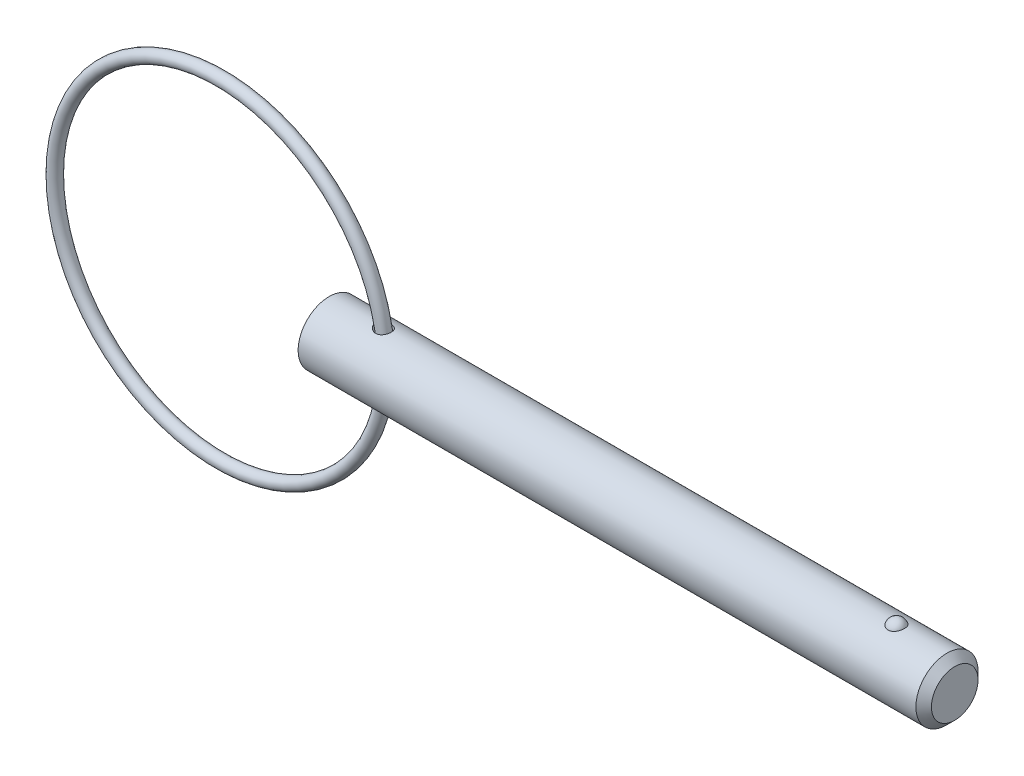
ISO-10303-21;
HEADER;
FILE_DESCRIPTION(('STEP AP214'),'2;1');
FILE_NAME('part.step','',(''),(''),'','','');
FILE_SCHEMA(('AUTOMOTIVE_DESIGN { 1 0 10303 214 1 1 1 1 }'));
ENDSEC;
DATA;
#1=APPLICATION_CONTEXT('core data for automotive mechanical design processes');
#2=APPLICATION_PROTOCOL_DEFINITION('international standard','automotive_design',2000,#1);
#3=PRODUCT_CONTEXT('',#1,'mechanical');
#4=PRODUCT('Part','Part','',(#3));
#5=PRODUCT_RELATED_PRODUCT_CATEGORY('part','',(#4));
#6=PRODUCT_DEFINITION_FORMATION('','',#4);
#7=PRODUCT_DEFINITION_CONTEXT('part definition',#1,'design');
#8=PRODUCT_DEFINITION('design','',#6,#7);
#9=PRODUCT_DEFINITION_SHAPE('','',#8);
#10=(LENGTH_UNIT() NAMED_UNIT(*) SI_UNIT(.MILLI.,.METRE.));
#11=(NAMED_UNIT(*) PLANE_ANGLE_UNIT() SI_UNIT($,.RADIAN.));
#12=(NAMED_UNIT(*) SI_UNIT($,.STERADIAN.) SOLID_ANGLE_UNIT());
#13=UNCERTAINTY_MEASURE_WITH_UNIT(LENGTH_MEASURE(1.E-05),#10,'distance_accuracy_value','');
#14=(GEOMETRIC_REPRESENTATION_CONTEXT(3) GLOBAL_UNCERTAINTY_ASSIGNED_CONTEXT((#13)) GLOBAL_UNIT_ASSIGNED_CONTEXT((#10,
#11,#12)) REPRESENTATION_CONTEXT('',''));
#15=CARTESIAN_POINT('',(0.,0.,0.));
#16=DIRECTION('',(0.,0.,1.));
#17=DIRECTION('',(1.,0.,0.));
#18=AXIS2_PLACEMENT_3D('',#15,#16,#17);
#19=CARTESIAN_POINT('',(-8.3302379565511,0.,0.));
#20=DIRECTION('',(0.,0.,1.));
#21=DIRECTION('',(1.,0.,0.));
#22=AXIS2_PLACEMENT_3D('',#19,#20,#21);
#23=TOROIDAL_SURFACE('',#22,12.7,0.476000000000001);
#24=CARTESIAN_POINT('',(4.8457620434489,0.,0.));
#25=VERTEX_POINT('',#24);
#26=VERTEX_LOOP('',#25);
#27=FACE_BOUND('',#26,.T.);
#28=ADVANCED_FACE('P0_F12',(#27),#23,.T.);
#29=CLOSED_SHELL('',(#28));
#30=MANIFOLD_SOLID_BREP('P0_B1',#29);
#31=CARTESIAN_POINT('',(0.,0.,0.));
#32=DIRECTION('',(1.,0.,0.));
#33=DIRECTION('',(0.,0.,-1.));
#34=AXIS2_PLACEMENT_3D('',#31,#32,#33);
#35=CYLINDRICAL_SURFACE('',#34,2.38);
#36=CARTESIAN_POINT('',(3.67748265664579,2.35074198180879,-0.372037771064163));
#37=CARTESIAN_POINT('',(3.70046616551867,2.34644965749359,-0.399158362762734));
#38=CARTESIAN_POINT('',(3.72581651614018,2.34199234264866,-0.424274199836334));
#39=CARTESIAN_POINT('',(3.78042747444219,2.33326580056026,-0.469907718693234));
#40=CARTESIAN_POINT('',(3.80969342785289,2.32899684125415,-0.490419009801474));
#41=CARTESIAN_POINT('',(3.87128330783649,2.32114904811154,-0.526312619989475));
#42=CARTESIAN_POINT('',(3.90360537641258,2.31756979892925,-0.541698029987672));
#43=CARTESIAN_POINT('',(3.9704452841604,2.31153734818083,-0.566889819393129));
#44=CARTESIAN_POINT('',(4.0049621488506,2.30908365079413,-0.576698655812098));
#45=CARTESIAN_POINT('',(4.07500735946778,2.30564492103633,-0.590297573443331));
#46=CARTESIAN_POINT('',(4.1105275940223,2.30465036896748,-0.594126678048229));
#47=CARTESIAN_POINT('',(4.18170718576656,2.30426876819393,-0.595606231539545));
#48=CARTESIAN_POINT('',(4.21736649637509,2.30488122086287,-0.593258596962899));
#49=CARTESIAN_POINT('',(4.28577822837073,2.30759475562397,-0.582609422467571));
#50=CARTESIAN_POINT('',(4.31858437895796,2.30961492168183,-0.574631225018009));
#51=CARTESIAN_POINT('',(4.38227060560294,2.31483318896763,-0.553233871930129));
#52=CARTESIAN_POINT('',(4.41315097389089,2.31803111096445,-0.539815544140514));
#53=CARTESIAN_POINT('',(4.4711825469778,2.3251225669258,-0.508384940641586));
#54=CARTESIAN_POINT('',(4.49841743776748,2.32899254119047,-0.490521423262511));
#55=CARTESIAN_POINT('',(4.5494826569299,2.33706025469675,-0.450515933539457));
#56=CARTESIAN_POINT('',(4.57331285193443,2.34125800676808,-0.42837379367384));
#57=CARTESIAN_POINT('',(4.6171621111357,2.34956202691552,-0.380209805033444));
#58=CARTESIAN_POINT('',(4.63714543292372,2.35366715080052,-0.354155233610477));
#59=CARTESIAN_POINT('',(4.67254725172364,2.36130301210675,-0.299034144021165));
#60=CARTESIAN_POINT('',(4.68796545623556,2.36483371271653,-0.26996743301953));
#61=CARTESIAN_POINT('',(4.71403776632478,2.37098548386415,-0.209215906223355));
#62=CARTESIAN_POINT('',(4.72462580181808,2.37359383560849,-0.177501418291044));
#63=CARTESIAN_POINT('',(4.74046966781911,2.37755210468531,-0.112692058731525));
#64=CARTESIAN_POINT('',(4.74572552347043,2.37890202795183,-0.0795971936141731));
#65=CARTESIAN_POINT('',(4.75077448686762,2.38019811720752,-0.0129544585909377));
#66=CARTESIAN_POINT('',(4.75056573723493,2.38014380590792,0.0205935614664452));
#67=CARTESIAN_POINT('',(4.74468604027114,2.37863606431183,0.0871753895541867));
#68=CARTESIAN_POINT('',(4.73901506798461,2.37718262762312,0.120209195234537));
#69=CARTESIAN_POINT('',(4.72236472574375,2.37303648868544,0.184779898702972));
#70=CARTESIAN_POINT('',(4.71139268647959,2.37034549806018,0.216318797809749));
#71=CARTESIAN_POINT('',(4.68441400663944,2.36401552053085,0.277063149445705));
#72=CARTESIAN_POINT('',(4.6684071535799,2.36037649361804,0.306268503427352));
#73=CARTESIAN_POINT('',(4.63170627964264,2.35253749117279,0.361595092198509));
#74=CARTESIAN_POINT('',(4.61100040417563,2.34833610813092,0.387708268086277));
#75=CARTESIAN_POINT('',(4.56544852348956,2.33984863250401,0.436017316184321));
#76=CARTESIAN_POINT('',(4.54060272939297,2.33556254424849,0.458213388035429));
#77=CARTESIAN_POINT('',(4.48760111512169,2.32742099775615,0.497916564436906));
#78=CARTESIAN_POINT('',(4.45946763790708,2.32356294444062,0.515452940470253));
#79=CARTESIAN_POINT('',(4.40055109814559,2.31668866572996,0.545520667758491));
#80=CARTESIAN_POINT('',(4.36976845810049,2.31367230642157,0.558052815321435));
#81=CARTESIAN_POINT('',(4.30694930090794,2.30886128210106,0.577633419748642));
#82=CARTESIAN_POINT('',(4.27493988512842,2.30704826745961,0.584764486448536));
#83=CARTESIAN_POINT('',(4.21014558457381,2.30475365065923,0.593744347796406));
#84=CARTESIAN_POINT('',(4.17736068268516,2.30427207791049,0.595593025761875));
#85=CARTESIAN_POINT('',(4.11170515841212,2.30466513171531,0.59406986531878));
#86=CARTESIAN_POINT('',(4.07883545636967,2.30554895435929,0.5906626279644));
#87=CARTESIAN_POINT('',(4.01408593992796,2.30856010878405,0.578780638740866));
#88=CARTESIAN_POINT('',(3.98220636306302,2.31068773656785,0.570304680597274));
#89=CARTESIAN_POINT('',(3.91877258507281,2.31605973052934,0.548090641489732));
#90=CARTESIAN_POINT('',(3.88730095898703,2.31935100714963,0.534128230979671));
#91=CARTESIAN_POINT('',(3.82705133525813,2.32664713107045,0.501391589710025));
#92=CARTESIAN_POINT('',(3.79827429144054,2.33065222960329,0.482615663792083));
#93=CARTESIAN_POINT('',(3.7429634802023,2.3391254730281,0.4397600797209));
#94=CARTESIAN_POINT('',(3.71658313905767,2.3436062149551,0.415484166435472));
#95=CARTESIAN_POINT('',(3.6683951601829,2.35235146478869,0.362706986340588));
#96=CARTESIAN_POINT('',(3.64658727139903,2.35661598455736,0.334205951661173));
#97=CARTESIAN_POINT('',(3.60882605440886,2.36432007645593,0.27436882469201));
#98=CARTESIAN_POINT('',(3.59274982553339,2.36777633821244,0.243112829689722));
#99=CARTESIAN_POINT('',(3.56652169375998,2.3735493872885,0.178112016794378));
#100=CARTESIAN_POINT('',(3.5563653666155,2.3758670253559,0.144369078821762));
#101=CARTESIAN_POINT('',(3.54309691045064,2.37891982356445,0.0783638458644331));
#102=CARTESIAN_POINT('',(3.53947205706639,2.37976992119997,0.0462095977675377));
#103=CARTESIAN_POINT('',(3.53785288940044,2.38014795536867,-0.018248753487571));
#104=CARTESIAN_POINT('',(3.5398575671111,2.37967612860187,-0.0505528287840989));
#105=CARTESIAN_POINT('',(3.54913867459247,2.37752661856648,-0.112617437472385));
#106=CARTESIAN_POINT('',(3.5561353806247,2.37591295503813,-0.142422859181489));
#107=CARTESIAN_POINT('',(3.5747775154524,2.37172196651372,-0.200451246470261));
#108=CARTESIAN_POINT('',(3.58642049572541,2.36914514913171,-0.228675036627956));
#109=CARTESIAN_POINT('',(3.61071901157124,2.36396321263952,-0.276620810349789));
#110=CARTESIAN_POINT('',(3.62251818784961,2.36150235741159,-0.296799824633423));
#111=CARTESIAN_POINT('',(3.64836661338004,2.35629864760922,-0.335619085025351));
#112=CARTESIAN_POINT('',(3.66241608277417,2.353555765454,-0.354259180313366));
#113=CARTESIAN_POINT('',(3.67748265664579,2.35074198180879,-0.372037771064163));
#114=B_SPLINE_CURVE_WITH_KNOTS('',3,(#36,#37,#38,#39,#40,#41,#42,#43,#44,#45,#46,#47,#48,#49,
#50,#51,#52,#53,#54,#55,#56,#57,#58,#59,#60,#61,#62,#63,#64,#65,#66,#67,#68,#69,#70,#71,#72,#73,
#74,#75,#76,#77,#78,#79,#80,#81,#82,#83,#84,#85,#86,#87,#88,#89,#90,#91,#92,#93,#94,#95,#96,#97,
#98,#99,#100,#101,#102,#103,#104,#105,#106,#107,#108,#109,#110,#111,#112,#113),.UNSPECIFIED.,
.T.,.F.,(4,2,2,2,2,2,2,2,2,2,2,2,2,2,2,2,2,2,2,2,2,2,2,2,2,2,2,2,2,2,2,2,2,2,2,2,2,2,4),(0.,
0.107335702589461,0.214819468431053,0.322238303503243,0.429609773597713,0.536277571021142,
0.642912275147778,0.743874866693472,0.844822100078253,0.942762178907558,1.04070609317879,
1.13952022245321,1.23834068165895,1.33847507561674,1.43860899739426,1.53877695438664,
1.63894536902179,1.7389756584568,1.83901017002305,1.93929990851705,2.03958453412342,
2.13922343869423,2.23884648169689,2.33691317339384,2.43498203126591,2.53371427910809,
2.63247003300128,2.73577311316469,2.83911262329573,2.94697761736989,3.05483668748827,
3.16021984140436,3.2655241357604,3.36212700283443,3.45871257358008,3.55027266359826,
3.64178456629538,3.71214035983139,3.78250304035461),.UNSPECIFIED.);
#115=CARTESIAN_POINT('',(3.67748265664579,2.35074198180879,-0.372037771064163));
#116=VERTEX_POINT('',#115);
#117=EDGE_CURVE('P1_E40',#116,#116,#114,.T.);
#118=ORIENTED_EDGE('',*,*,#117,.T.);
#119=EDGE_LOOP('',(#118));
#120=FACE_BOUND('',#119,.T.);
#121=CARTESIAN_POINT('',(47.335,0.,0.));
#122=DIRECTION('',(1.,0.,0.));
#123=DIRECTION('',(0.,0.,-1.));
#124=AXIS2_PLACEMENT_3D('',#121,#122,#123);
#125=CIRCLE('',#124,2.38);
#126=CARTESIAN_POINT('',(47.335,0.,-2.38));
#127=VERTEX_POINT('',#126);
#128=EDGE_CURVE('P1_E25',#127,#127,#125,.T.);
#129=ORIENTED_EDGE('',*,*,#128,.F.);
#130=EDGE_LOOP('',(#129));
#131=FACE_BOUND('',#130,.T.);
#132=CARTESIAN_POINT('',(0.,0.,0.));
#133=DIRECTION('',(1.,0.,0.));
#134=DIRECTION('',(0.,0.,-1.));
#135=AXIS2_PLACEMENT_3D('',#132,#133,#134);
#136=CIRCLE('',#135,2.38);
#137=CARTESIAN_POINT('',(0.,0.,-2.38));
#138=VERTEX_POINT('',#137);
#139=EDGE_CURVE('P1_E9',#138,#138,#136,.T.);
#140=ORIENTED_EDGE('',*,*,#139,.T.);
#141=EDGE_LOOP('',(#140));
#142=FACE_BOUND('',#141,.T.);
#143=CARTESIAN_POINT('',(43.4634492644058,2.2921568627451,0.64063789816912));
#144=CARTESIAN_POINT('',(43.4303559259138,2.29215737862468,0.640637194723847));
#145=CARTESIAN_POINT('',(43.3972546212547,2.29293179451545,0.63788468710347));
#146=CARTESIAN_POINT('',(43.3320176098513,2.29594030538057,0.626968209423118));
#147=CARTESIAN_POINT('',(43.2998823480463,2.29817506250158,0.618801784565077));
#148=CARTESIAN_POINT('',(43.2375402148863,2.30384308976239,0.597351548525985));
#149=CARTESIAN_POINT('',(43.2073305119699,2.30727454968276,0.58407546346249));
#150=CARTESIAN_POINT('',(43.1495674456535,2.31495941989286,0.552829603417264));
#151=CARTESIAN_POINT('',(43.1220141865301,2.31921286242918,0.534859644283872));
#152=CARTESIAN_POINT('',(43.0695938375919,2.32820213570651,0.494282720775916));
#153=CARTESIAN_POINT('',(43.0448050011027,2.33294694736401,0.471576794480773));
#154=CARTESIAN_POINT('',(42.9992169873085,2.34234144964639,0.422446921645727));
#155=CARTESIAN_POINT('',(42.9784185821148,2.34699112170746,0.396022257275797));
#156=CARTESIAN_POINT('',(42.9403580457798,2.35593942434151,0.338855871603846));
#157=CARTESIAN_POINT('',(42.9233051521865,2.36021170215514,0.30797060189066));
#158=CARTESIAN_POINT('',(42.8943607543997,2.3677057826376,0.24375057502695));
#159=CARTESIAN_POINT('',(42.8824701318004,2.37092740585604,0.210415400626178));
#160=CARTESIAN_POINT('',(42.8638076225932,2.37606901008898,0.141189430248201));
#161=CARTESIAN_POINT('',(42.8571956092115,2.37794816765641,0.105252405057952));
#162=CARTESIAN_POINT('',(42.8498095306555,2.38005135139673,0.0327351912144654));
#163=CARTESIAN_POINT('',(42.8490358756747,2.38027526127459,-0.00384504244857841));
#164=CARTESIAN_POINT('',(42.8533628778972,2.37903842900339,-0.0769838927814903));
#165=CARTESIAN_POINT('',(42.8585202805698,2.37756141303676,-0.113538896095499));
#166=CARTESIAN_POINT('',(42.8747013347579,2.37305303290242,-0.185229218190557));
#167=CARTESIAN_POINT('',(42.8857251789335,2.37002161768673,-0.220364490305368));
#168=CARTESIAN_POINT('',(42.9133977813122,2.36273722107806,-0.288156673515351));
#169=CARTESIAN_POINT('',(42.9300389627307,2.35848588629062,-0.320816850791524));
#170=CARTESIAN_POINT('',(42.9685984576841,2.34923130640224,-0.382744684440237));
#171=CARTESIAN_POINT('',(42.990516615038,2.34422808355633,-0.41201244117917));
#172=CARTESIAN_POINT('',(43.0387549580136,2.33412555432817,-0.46583000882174));
#173=CARTESIAN_POINT('',(43.065002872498,2.32902887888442,-0.490444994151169));
#174=CARTESIAN_POINT('',(43.1214769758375,2.31926941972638,-0.5347003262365));
#175=CARTESIAN_POINT('',(43.151702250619,2.3146065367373,-0.554341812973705));
#176=CARTESIAN_POINT('',(43.2140618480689,2.30645675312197,-0.587312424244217));
#177=CARTESIAN_POINT('',(43.2460780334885,2.30293152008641,-0.600855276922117));
#178=CARTESIAN_POINT('',(43.3120795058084,2.29725171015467,-0.622220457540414));
#179=CARTESIAN_POINT('',(43.3460641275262,2.29509667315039,-0.630044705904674));
#180=CARTESIAN_POINT('',(43.413299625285,2.29249264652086,-0.639452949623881));
#181=CARTESIAN_POINT('',(43.4465087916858,2.29196755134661,-0.641315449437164));
#182=CARTESIAN_POINT('',(43.512763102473,2.29246849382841,-0.639522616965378));
#183=CARTESIAN_POINT('',(43.5458082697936,2.29349430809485,-0.635868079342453));
#184=CARTESIAN_POINT('',(43.6101025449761,2.29694059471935,-0.623301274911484));
#185=CARTESIAN_POINT('',(43.6413744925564,2.29933234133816,-0.614497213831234));
#186=CARTESIAN_POINT('',(43.7019952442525,2.30522511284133,-0.592006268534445));
#187=CARTESIAN_POINT('',(43.7313438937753,2.30872622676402,-0.578318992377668));
#188=CARTESIAN_POINT('',(43.7880369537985,2.31655795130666,-0.546112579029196));
#189=CARTESIAN_POINT('',(43.815320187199,2.32090569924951,-0.527490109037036));
#190=CARTESIAN_POINT('',(43.8664904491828,2.32992206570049,-0.486117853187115));
#191=CARTESIAN_POINT('',(43.8903767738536,2.33459075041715,-0.463367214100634));
#192=CARTESIAN_POINT('',(43.9352722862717,2.34399834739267,-0.413220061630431));
#193=CARTESIAN_POINT('',(43.9560972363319,2.34873051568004,-0.385657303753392));
#194=CARTESIAN_POINT('',(43.993056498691,2.35754932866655,-0.327455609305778));
#195=CARTESIAN_POINT('',(44.0091898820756,2.36163584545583,-0.296816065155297));
#196=CARTESIAN_POINT('',(44.0369822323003,2.36889321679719,-0.23204704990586));
#197=CARTESIAN_POINT('',(44.0484450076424,2.37202275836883,-0.197828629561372));
#198=CARTESIAN_POINT('',(44.0657523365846,2.37681926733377,-0.127900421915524));
#199=CARTESIAN_POINT('',(44.0715962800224,2.37848607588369,-0.0921904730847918));
#200=CARTESIAN_POINT('',(44.077605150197,2.38020024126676,-0.0196348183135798));
#201=CARTESIAN_POINT('',(44.0776704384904,2.38021918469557,0.017219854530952));
#202=CARTESIAN_POINT('',(44.0718689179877,2.37856356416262,0.09042190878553));
#203=CARTESIAN_POINT('',(44.0660018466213,2.37688892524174,0.126769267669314));
#204=CARTESIAN_POINT('',(44.048425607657,2.37201688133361,0.198028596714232));
#205=CARTESIAN_POINT('',(44.0366998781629,2.36881516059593,0.232936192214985));
#206=CARTESIAN_POINT('',(44.0076354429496,2.36123444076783,0.300196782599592));
#207=CARTESIAN_POINT('',(43.9902967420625,2.3568554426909,0.332549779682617));
#208=CARTESIAN_POINT('',(43.9505350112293,2.34744667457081,0.393495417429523));
#209=CARTESIAN_POINT('',(43.9281528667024,2.34242227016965,0.422115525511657));
#210=CARTESIAN_POINT('',(43.8787391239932,2.33227293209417,0.475004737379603));
#211=CARTESIAN_POINT('',(43.8517076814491,2.32714800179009,0.499273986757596));
#212=CARTESIAN_POINT('',(43.7944988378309,2.31755359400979,0.542046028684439));
#213=CARTESIAN_POINT('',(43.7644297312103,2.3130698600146,0.56069032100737));
#214=CARTESIAN_POINT('',(43.7013869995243,2.3051412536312,0.59244718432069));
#215=CARTESIAN_POINT('',(43.6684158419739,2.30169550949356,0.605564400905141));
#216=CARTESIAN_POINT('',(43.6068424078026,2.29677744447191,0.623927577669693));
#217=CARTESIAN_POINT('',(43.5785555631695,2.29505839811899,0.630178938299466));
#218=CARTESIAN_POINT('',(43.5213308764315,2.29274795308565,0.638534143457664));
#219=CARTESIAN_POINT('',(43.4923931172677,2.29215641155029,0.640638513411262));
#220=CARTESIAN_POINT('',(43.4634492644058,2.2921568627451,0.64063789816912));
#221=B_SPLINE_CURVE_WITH_KNOTS('',3,(#143,#144,#145,#146,#147,#148,#149,#150,#151,#152,#153,
#154,#155,#156,#157,#158,#159,#160,#161,#162,#163,#164,#165,#166,#167,#168,#169,#170,#171,#172,
#173,#174,#175,#176,#177,#178,#179,#180,#181,#182,#183,#184,#185,#186,#187,#188,#189,#190,#191,
#192,#193,#194,#195,#196,#197,#198,#199,#200,#201,#202,#203,#204,#205,#206,#207,#208,#209,#210,
#211,#212,#213,#214,#215,#216,#217,#218,#219,#220),.UNSPECIFIED.,.T.,.F.,(4,2,2,2,2,2,2,2,2,2,2,
2,2,2,2,2,2,2,2,2,2,2,2,2,2,2,2,2,2,2,2,2,2,2,2,2,2,2,4),(0.,0.0991724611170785,
0.198389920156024,0.29745794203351,0.396529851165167,0.497927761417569,0.599345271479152,
0.705475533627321,0.811623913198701,0.920876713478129,1.03013718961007,1.14045177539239,
1.25076998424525,1.36093998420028,1.47110672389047,1.57959248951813,1.68805336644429,
1.79234266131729,1.89659691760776,1.9959039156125,2.09519661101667,2.19247425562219,
2.28975970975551,2.38926978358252,2.4888004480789,2.59293588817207,2.69709193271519,
2.80525821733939,2.9134362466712,3.02347917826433,3.13352698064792,3.243887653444,
3.3542482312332,3.46374443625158,3.57323697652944,3.67968690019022,3.78604717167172,
3.87279565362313,3.95953314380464),.UNSPECIFIED.);
#222=CARTESIAN_POINT('',(43.4634492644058,2.2921568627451,0.64063789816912));
#223=VERTEX_POINT('',#222);
#224=EDGE_CURVE('P1_E34',#223,#223,#221,.T.);
#225=ORIENTED_EDGE('',*,*,#224,.T.);
#226=EDGE_LOOP('',(#225));
#227=FACE_BOUND('',#226,.T.);
#228=CARTESIAN_POINT('',(3.67748265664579,-2.35074198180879,-0.372037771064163));
#229=CARTESIAN_POINT('',(3.65652023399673,-2.35465684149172,-0.34730037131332));
#230=CARTESIAN_POINT('',(3.63751328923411,-2.35843676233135,-0.320880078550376));
#231=CARTESIAN_POINT('',(3.60404107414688,-2.36534227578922,-0.265218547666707));
#232=CARTESIAN_POINT('',(3.58957485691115,-2.36846800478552,-0.235977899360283));
#233=CARTESIAN_POINT('',(3.56572865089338,-2.37373250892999,-0.17528149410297));
#234=CARTESIAN_POINT('',(3.55636565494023,-2.37586798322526,-0.143818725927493));
#235=CARTESIAN_POINT('',(3.54325775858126,-2.37888184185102,-0.0796854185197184));
#236=CARTESIAN_POINT('',(3.539510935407,-2.37976065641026,-0.047015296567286));
#237=CARTESIAN_POINT('',(3.53787230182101,-2.38014359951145,0.0167788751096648));
#238=CARTESIAN_POINT('',(3.53968714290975,-2.37971660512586,0.0478953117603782));
#239=CARTESIAN_POINT('',(3.54844977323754,-2.37768530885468,0.10935299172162));
#240=CARTESIAN_POINT('',(3.55539746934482,-2.37608102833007,0.139694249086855));
#241=CARTESIAN_POINT('',(3.57400783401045,-2.37189301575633,0.198451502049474));
#242=CARTESIAN_POINT('',(3.58561918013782,-2.36931996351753,0.226884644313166));
#243=CARTESIAN_POINT('',(3.61310377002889,-2.36345094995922,0.281524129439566));
#244=CARTESIAN_POINT('',(3.62897804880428,-2.36015481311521,0.307729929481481));
#245=CARTESIAN_POINT('',(3.66562367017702,-2.35291979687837,0.359001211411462));
#246=CARTESIAN_POINT('',(3.68664499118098,-2.34895316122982,0.38388386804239));
#247=CARTESIAN_POINT('',(3.73230875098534,-2.34094029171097,0.430056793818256));
#248=CARTESIAN_POINT('',(3.75695270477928,-2.33689402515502,0.451345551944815));
#249=CARTESIAN_POINT('',(3.81128123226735,-2.32880869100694,0.491427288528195));
#250=CARTESIAN_POINT('',(3.84120889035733,-2.32479472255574,0.509896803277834));
#251=CARTESIAN_POINT('',(3.90376464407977,-2.31758417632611,0.541729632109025));
#252=CARTESIAN_POINT('',(3.93639323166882,-2.31438774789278,0.555092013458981));
#253=CARTESIAN_POINT('',(4.00416670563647,-2.30915137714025,0.576493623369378));
#254=CARTESIAN_POINT('',(4.0393485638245,-2.30713552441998,0.584422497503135));
#255=CARTESIAN_POINT('',(4.11060438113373,-2.30465258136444,0.594140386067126));
#256=CARTESIAN_POINT('',(4.14667802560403,-2.30418495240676,0.595931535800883));
#257=CARTESIAN_POINT('',(4.21693481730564,-2.30488473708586,0.593218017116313));
#258=CARTESIAN_POINT('',(4.25112951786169,-2.30597897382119,0.588995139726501));
#259=CARTESIAN_POINT('',(4.31821509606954,-2.30956729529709,0.57476284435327));
#260=CARTESIAN_POINT('',(4.35110629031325,-2.31206103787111,0.564754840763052));
#261=CARTESIAN_POINT('',(4.41316900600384,-2.31802118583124,0.53975368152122));
#262=CARTESIAN_POINT('',(4.44243993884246,-2.32144077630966,0.524995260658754));
#263=CARTESIAN_POINT('',(4.49802365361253,-2.32890801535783,0.49080792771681));
#264=CARTESIAN_POINT('',(4.52433643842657,-2.33295566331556,0.471379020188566));
#265=CARTESIAN_POINT('',(4.57327790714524,-2.3412242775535,0.428422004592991));
#266=CARTESIAN_POINT('',(4.59591094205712,-2.34544503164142,0.404898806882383));
#267=CARTESIAN_POINT('',(4.63697038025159,-2.35360640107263,0.354387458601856));
#268=CARTESIAN_POINT('',(4.65539647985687,-2.35754699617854,0.327399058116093));
#269=CARTESIAN_POINT('',(4.68784943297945,-2.36478461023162,0.270249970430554));
#270=CARTESIAN_POINT('',(4.70180333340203,-2.36807065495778,0.240046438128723));
#271=CARTESIAN_POINT('',(4.72457181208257,-2.3735656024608,0.177668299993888));
#272=CARTESIAN_POINT('',(4.73338630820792,-2.37577448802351,0.145493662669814));
#273=CARTESIAN_POINT('',(4.74568442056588,-2.37888446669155,0.0799353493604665));
#274=CARTESIAN_POINT('',(4.74914498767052,-2.37977990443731,0.0465470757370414));
#275=CARTESIAN_POINT('',(4.75057509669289,-2.38014803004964,-0.0203543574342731));
#276=CARTESIAN_POINT('',(4.74854468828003,-2.37962073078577,-0.0538675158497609));
#277=CARTESIAN_POINT('',(4.73905606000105,-2.37720346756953,-0.119981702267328));
#278=CARTESIAN_POINT('',(4.73161109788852,-2.37531683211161,-0.152584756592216));
#279=CARTESIAN_POINT('',(4.71149336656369,-2.37038779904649,-0.21604453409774));
#280=CARTESIAN_POINT('',(4.69882040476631,-2.36734535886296,-0.246901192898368));
#281=CARTESIAN_POINT('',(4.66852750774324,-2.3604270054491,-0.306062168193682));
#282=CARTESIAN_POINT('',(4.65089743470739,-2.35654938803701,-0.334361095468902));
#283=CARTESIAN_POINT('',(4.61113860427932,-2.34839114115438,-0.387535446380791));
#284=CARTESIAN_POINT('',(4.5890098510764,-2.34411051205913,-0.412410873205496));
#285=CARTESIAN_POINT('',(4.54086484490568,-2.33563475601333,-0.457982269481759));
#286=CARTESIAN_POINT('',(4.51485596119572,-2.33143948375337,-0.478685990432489));
#287=CARTESIAN_POINT('',(4.45962330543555,-2.32360655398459,-0.515369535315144));
#288=CARTESIAN_POINT('',(4.43040000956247,-2.31996881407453,-0.53135005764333));
#289=CARTESIAN_POINT('',(4.37002624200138,-2.31371771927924,-0.557938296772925));
#290=CARTESIAN_POINT('',(4.33891082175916,-2.31108995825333,-0.56862225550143));
#291=CARTESIAN_POINT('',(4.27527207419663,-2.30707117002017,-0.584715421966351));
#292=CARTESIAN_POINT('',(4.24274884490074,-2.30568005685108,-0.590124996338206));
#293=CARTESIAN_POINT('',(4.17738918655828,-2.30427145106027,-0.595601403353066));
#294=CARTESIAN_POINT('',(4.14455499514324,-2.3042474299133,-0.595693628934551));
#295=CARTESIAN_POINT('',(4.07930726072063,-2.30552664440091,-0.590722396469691));
#296=CARTESIAN_POINT('',(4.04689380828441,-2.3068301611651,-0.585657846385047));
#297=CARTESIAN_POINT('',(3.98220150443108,-2.31066076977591,-0.570360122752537));
#298=CARTESIAN_POINT('',(3.94996602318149,-2.31322859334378,-0.559954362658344));
#299=CARTESIAN_POINT('',(3.88760707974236,-2.31930140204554,-0.534242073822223));
#300=CARTESIAN_POINT('',(3.85748403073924,-2.32280656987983,-0.518934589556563));
#301=CARTESIAN_POINT('',(3.80033132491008,-2.33034138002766,-0.483968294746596));
#302=CARTESIAN_POINT('',(3.77327623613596,-2.33436601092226,-0.464349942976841));
#303=CARTESIAN_POINT('',(3.72262060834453,-2.34255524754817,-0.421092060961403));
#304=CARTESIAN_POINT('',(3.69901956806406,-2.34671983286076,-0.397453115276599));
#305=CARTESIAN_POINT('',(3.67748265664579,-2.35074198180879,-0.372037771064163));
#306=B_SPLINE_CURVE_WITH_KNOTS('',3,(#228,#229,#230,#231,#232,#233,#234,#235,#236,#237,#238,
#239,#240,#241,#242,#243,#244,#245,#246,#247,#248,#249,#250,#251,#252,#253,#254,#255,#256,#257,
#258,#259,#260,#261,#262,#263,#264,#265,#266,#267,#268,#269,#270,#271,#272,#273,#274,#275,#276,
#277,#278,#279,#280,#281,#282,#283,#284,#285,#286,#287,#288,#289,#290,#291,#292,#293,#294,#295,
#296,#297,#298,#299,#300,#301,#302,#303,#304,#305),.UNSPECIFIED.,.T.,.F.,(4,2,2,2,2,2,2,2,2,2,2,
2,2,2,2,2,2,2,2,2,2,2,2,2,2,2,2,2,2,2,2,2,2,2,2,2,2,2,4),(0.,0.09787553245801,0.19573064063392,
0.293909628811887,0.39205499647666,0.485114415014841,0.578172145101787,0.670232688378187,
0.762315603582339,0.860342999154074,0.958411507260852,1.06411708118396,1.16984195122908,
1.27765506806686,1.38543067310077,1.48831936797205,1.59118291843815,1.68959047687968,
1.78799793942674,1.88628818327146,1.98458551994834,2.08441314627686,2.18424236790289,
2.28450017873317,2.3847570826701,2.4847693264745,2.58478525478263,2.68500723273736,
2.78522911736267,2.8852630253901,2.98528213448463,3.08381637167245,3.18234375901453,
3.28040059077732,3.37847819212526,3.47994551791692,3.58143263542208,3.68200512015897,
3.78256299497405),.UNSPECIFIED.);
#307=CARTESIAN_POINT('',(3.67748265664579,-2.35074198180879,-0.372037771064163));
#308=VERTEX_POINT('',#307);
#309=EDGE_CURVE('P1_E17',#308,#308,#306,.T.);
#310=ORIENTED_EDGE('',*,*,#309,.T.);
#311=EDGE_LOOP('',(#310));
#312=FACE_BOUND('',#311,.T.);
#313=ADVANCED_FACE('P1_F13',(#120,#131,#142,#227,#312),#35,.T.);
#314=CARTESIAN_POINT('',(0.,0.,0.));
#315=DIRECTION('',(-1.,0.,0.));
#316=DIRECTION('',(0.,0.,1.));
#317=AXIS2_PLACEMENT_3D('',#314,#315,#316);
#318=PLANE('',#317);
#319=ORIENTED_EDGE('',*,*,#139,.F.);
#320=EDGE_LOOP('',(#319));
#321=FACE_BOUND('',#320,.T.);
#322=ADVANCED_FACE('P1_F15',(#321),#318,.T.);
#323=CARTESIAN_POINT('',(47.93,0.,0.));
#324=DIRECTION('',(-1.,0.,0.));
#325=DIRECTION('',(0.,0.,1.));
#326=AXIS2_PLACEMENT_3D('',#323,#324,#325);
#327=CONICAL_SURFACE('',#326,1.78500000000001,0.785398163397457);
#328=ORIENTED_EDGE('',*,*,#128,.T.);
#329=EDGE_LOOP('',(#328));
#330=FACE_BOUND('',#329,.T.);
#331=CARTESIAN_POINT('',(47.93,0.,0.));
#332=DIRECTION('',(1.,0.,0.));
#333=DIRECTION('',(0.,0.,-1.));
#334=AXIS2_PLACEMENT_3D('',#331,#332,#333);
#335=CIRCLE('',#334,1.78500000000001);
#336=CARTESIAN_POINT('',(47.93,0.,-1.78500000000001));
#337=VERTEX_POINT('',#336);
#338=EDGE_CURVE('P1_E30',#337,#337,#335,.T.);
#339=ORIENTED_EDGE('',*,*,#338,.F.);
#340=EDGE_LOOP('',(#339));
#341=FACE_BOUND('',#340,.T.);
#342=ADVANCED_FACE('P1_F55',(#330,#341),#327,.T.);
#343=CARTESIAN_POINT('',(47.93,1.78500000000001,0.));
#344=DIRECTION('',(1.,0.,0.));
#345=DIRECTION('',(0.,0.,-1.));
#346=AXIS2_PLACEMENT_3D('',#343,#344,#345);
#347=PLANE('',#346);
#348=ORIENTED_EDGE('',*,*,#338,.T.);
#349=EDGE_LOOP('',(#348));
#350=FACE_BOUND('',#349,.T.);
#351=ADVANCED_FACE('P1_F51',(#350),#347,.T.);
#352=CARTESIAN_POINT('',(43.4634492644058,2.142,0.));
#353=DIRECTION('',(-1.,0.,0.));
#354=DIRECTION('',(0.,1.,0.));
#355=AXIS2_PLACEMENT_3D('',#352,#353,#354);
#356=SPHERICAL_SURFACE('',#355,0.657999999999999);
#357=ORIENTED_EDGE('',*,*,#224,.F.);
#358=EDGE_LOOP('',(#357));
#359=FACE_BOUND('',#358,.T.);
#360=ADVANCED_FACE('P1_F46',(#359),#356,.T.);
#361=CARTESIAN_POINT('',(-8.3302379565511,0.,0.));
#362=DIRECTION('',(0.,0.,1.));
#363=DIRECTION('',(1.,0.,0.));
#364=AXIS2_PLACEMENT_3D('',#361,#362,#363);
#365=TOROIDAL_SURFACE('',#364,12.7,0.594999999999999);
#366=ORIENTED_EDGE('',*,*,#309,.F.);
#367=EDGE_LOOP('',(#366));
#368=FACE_BOUND('',#367,.T.);
#369=ORIENTED_EDGE('',*,*,#117,.F.);
#370=EDGE_LOOP('',(#369));
#371=FACE_BOUND('',#370,.T.);
#372=ADVANCED_FACE('P1_F50',(#368,#371),#365,.F.);
#373=CLOSED_SHELL('',(#313,#322,#342,#351,#360,#372));
#374=MANIFOLD_SOLID_BREP('P1_B1',#373);
#375=ADVANCED_BREP_SHAPE_REPRESENTATION('',(#18,#30,#374),#14);
#376=SHAPE_DEFINITION_REPRESENTATION(#9,#375);
ENDSEC;
END-ISO-10303-21;
